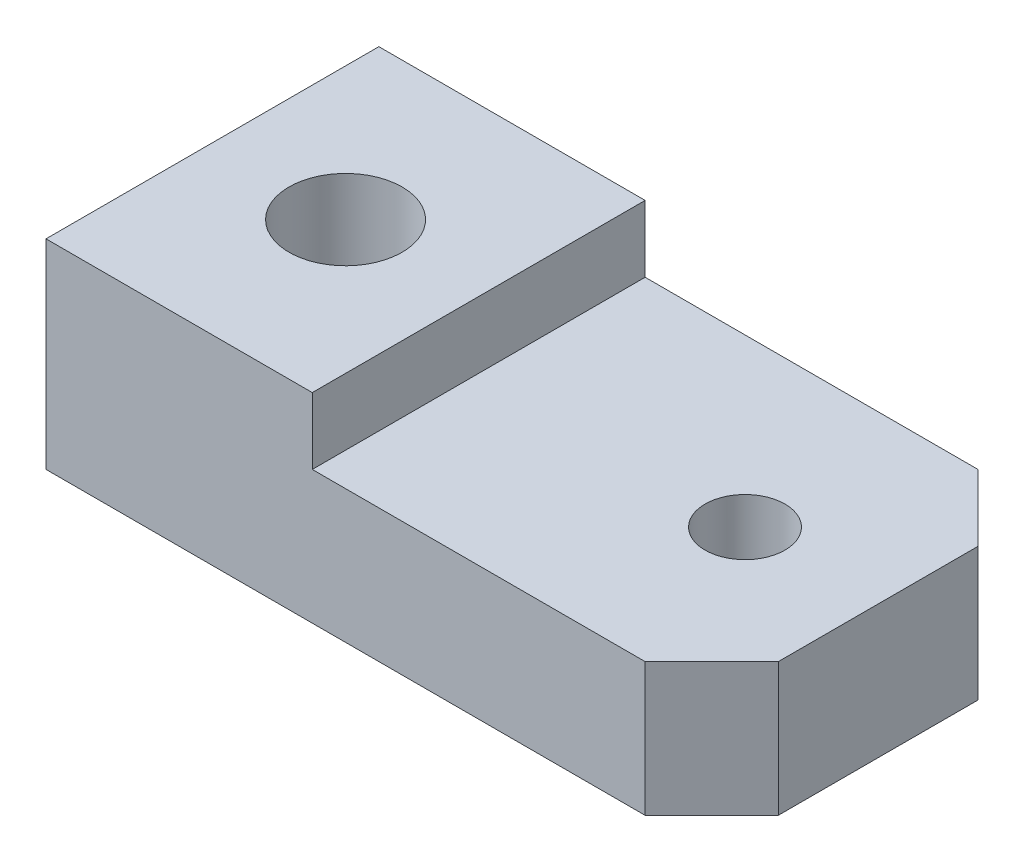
from build123d import *

# Parameters (mm, degrees)
BASE_EXTRUSION_DEPTH = 25
PER_AGE1_D           = 8.5
PER_AGE2_D           = 5
PER_AGE2_CBORE_D     = 6
PER_AGE2_CBORE_DEPTH = 12
CHANFREIN1_SIZE      = 5


with BuildPart() as part:
    # Esquisse1 → Base-Extrusion (new body)
    with BuildSketch(Plane.XY):
        Polygon((-50, 0), (0, 0), (0, 10), (-30, 10), (-30, 15), (-50, 15), align=None)
    extrude(amount=BASE_EXTRUSION_DEPTH)

    # Per_age1 (through all)
    with Locations(Plane.XZ):
        with Locations((-40, 12.5)):
            Hole(PER_AGE1_D / 2)

    # Per_age2 (through all)
    with Locations(Plane.XZ):
        with Locations((-10, 12.5)):
            CounterBoreHole(PER_AGE2_D / 2, PER_AGE2_CBORE_D / 2, PER_AGE2_CBORE_DEPTH)

    # Chanfrein1
    chanfrein1_edges = [part.edges().sort_by_distance(p)[0] for p in [
        (0, 5, 0),
        (0, 5, 25),
    ]]
    chamfer(chanfrein1_edges, length=CHANFREIN1_SIZE)


solid = part.part
